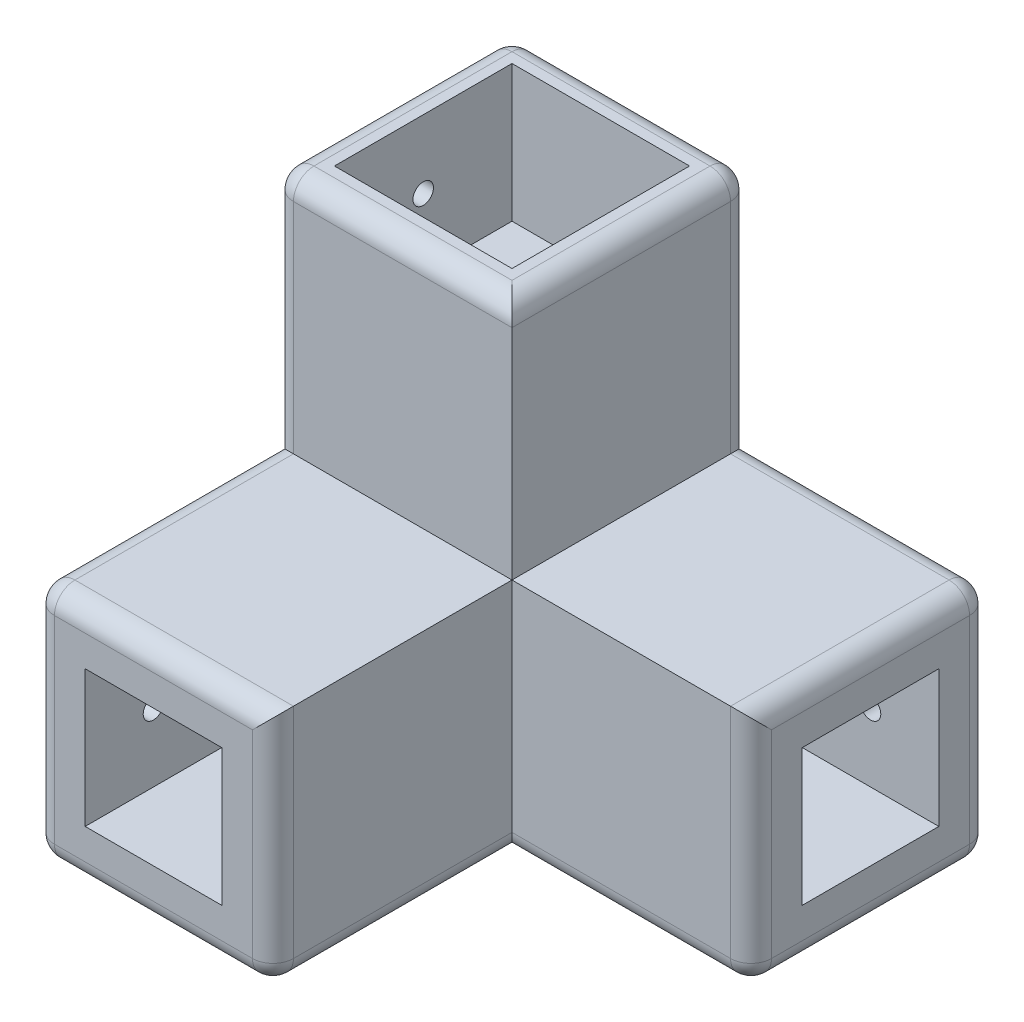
from build123d import *

# Parameters (mm, degrees)
BOSS_EXTRUDE1_DEPTH = 35
SKETCH2_W           = 35
SKETCH2_H           = 35
BOSS_EXTRUDE2_DEPTH = 35
SKETCH3_W           = 20
SKETCH3_H           = 20
CUT_EXTRUDE1_DEPTH  = 20
SKETCH4_W           = 20
SKETCH4_H           = 20
CUT_EXTRUDE2_DEPTH  = 20
SKETCH5_W           = 26
SKETCH5_H           = 26
CUT_EXTRUDE3_DEPTH  = 20
FILLET1_R           = 3
SKETCH7_R           = 1.5
CUT_EXTRUDE4_DEPTH  = 10
SKETCH8_R           = 1.5
CUT_EXTRUDE5_DEPTH  = 10


with BuildPart() as part:
    # Sketch1 → Boss-Extrude1 (new body)
    with BuildSketch(Plane.XY):
        Polygon((0, 70), (0, 0), (70, 0), (70, 35), (35, 35), (35, 70), align=None)
    extrude(amount=BOSS_EXTRUDE1_DEPTH)

    # Sketch2 → Boss-Extrude2 (add)
    with BuildSketch(Plane.XY.offset(35)):
        with Locations((17.5, 17.5)):
            Rectangle(SKETCH2_W, SKETCH2_H)
    extrude(amount=BOSS_EXTRUDE2_DEPTH)

    # Sketch3 → Cut-Extrude1 (cut)
    with BuildSketch(Plane.XY.offset(70)):
        with Locations((17.5, 17.5)):
            Rectangle(SKETCH3_W, SKETCH3_H)
    extrude(amount=-CUT_EXTRUDE1_DEPTH, mode=Mode.SUBTRACT)

    # Sketch4 → Cut-Extrude2 (cut)
    with BuildSketch(Plane(origin=(70, 0, 0), x_dir=(0, 0, -1), z_dir=(1, 0, 0))):
        with Locations((-17.5, 17.5)):
            Rectangle(SKETCH4_W, SKETCH4_H)
    extrude(amount=-CUT_EXTRUDE2_DEPTH, mode=Mode.SUBTRACT)

    # Sketch5 → Cut-Extrude3 (cut)
    with BuildSketch(Plane(origin=(0, 70, 0), x_dir=(1, 0, 0), z_dir=(0, 1, 0))):
        with Locations((17.5, -17.5)):
            Rectangle(SKETCH5_W, SKETCH5_H)
    extrude(amount=-CUT_EXTRUDE3_DEPTH, mode=Mode.SUBTRACT)

    # Fillet1
    fillet1_edges = [part.edges().sort_by_distance(p)[0] for p in [
        (35, 70, 17.5),
        (70, 35, 17.5),
        (70, 0, 17.5),
        (0, 0, 35),
        (0, 70, 17.5),
        (70, 17.5, 35),
        (52.5, 0, 35),
        (35, 0, 52.5),
        (0, 35, 52.5),
        (35, 17.5, 70),
        (17.5, 35, 70),
        (0, 17.5, 70),
        (17.5, 0, 70),
        (17.5, 70, 35),
        (35, 52.5, 0),
        (52.5, 35, 0),
        (70, 17.5, 0),
        (35, 0, 0),
        (0, 35, 0),
        (17.5, 70, 0),
        (0, 52.5, 35),
    ]]
    fillet(fillet1_edges, radius=FILLET1_R)

    # Sketch7 → Cut-Extrude4 (cut)
    with BuildSketch(Plane.ZY):
        with Locations(Location((60, 17.5, 0), (0, 0, 270))):
            Circle(SKETCH7_R)
        with Locations(Location((17.5, 60, 0), (0, 0, 270))):
            Circle(SKETCH7_R)
    extrude(amount=-CUT_EXTRUDE4_DEPTH, mode=Mode.SUBTRACT)

    # Sketch8 → Cut-Extrude5 (cut)
    with BuildSketch(Plane(origin=(0, 0, 0), x_dir=(-1, 0, 0), z_dir=(0, 0, -1))):
        with Locations((-60, 17.5)):
            Circle(SKETCH8_R)
    extrude(amount=-CUT_EXTRUDE5_DEPTH, mode=Mode.SUBTRACT)


solid = part.part
